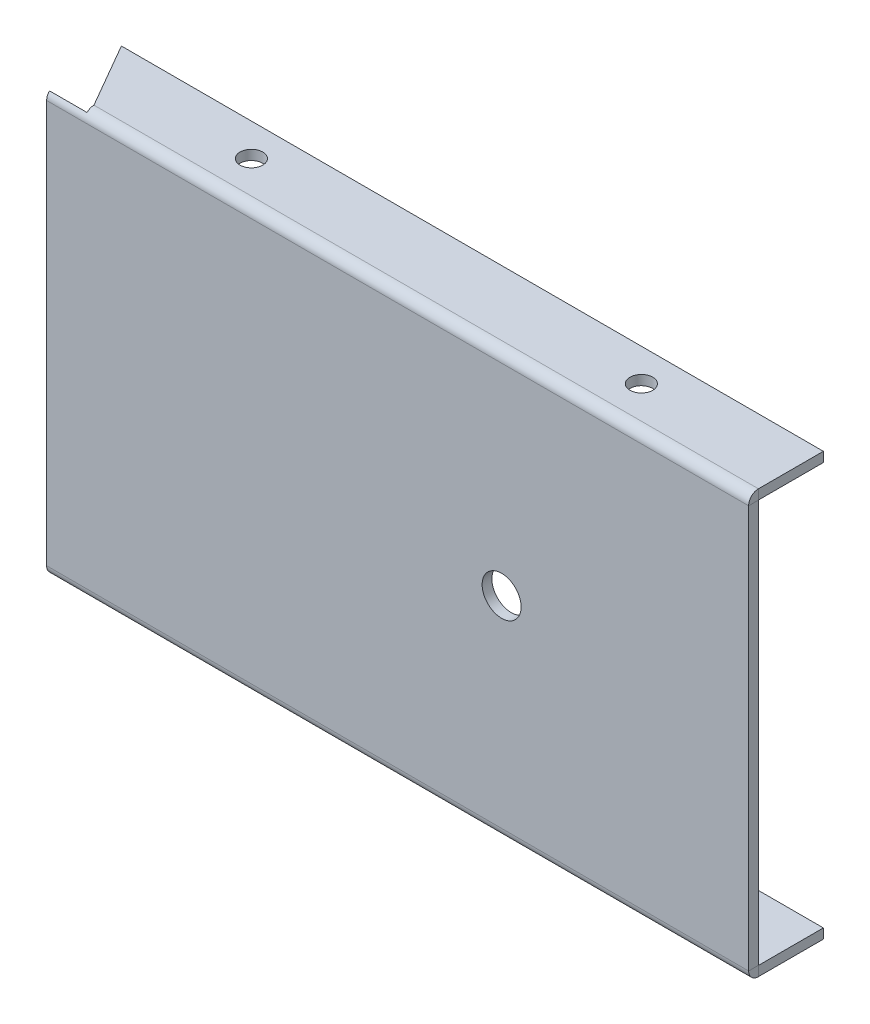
ISO-10303-21;
HEADER;
FILE_DESCRIPTION(('STEP AP214'),'2;1');
FILE_NAME('part.step','',(''),(''),'','','');
FILE_SCHEMA(('AUTOMOTIVE_DESIGN { 1 0 10303 214 1 1 1 1 }'));
ENDSEC;
DATA;
#1=APPLICATION_CONTEXT('core data for automotive mechanical design processes');
#2=APPLICATION_PROTOCOL_DEFINITION('international standard','automotive_design',2000,#1);
#3=PRODUCT_CONTEXT('',#1,'mechanical');
#4=PRODUCT('Part','Part','',(#3));
#5=PRODUCT_RELATED_PRODUCT_CATEGORY('part','',(#4));
#6=PRODUCT_DEFINITION_FORMATION('','',#4);
#7=PRODUCT_DEFINITION_CONTEXT('part definition',#1,'design');
#8=PRODUCT_DEFINITION('design','',#6,#7);
#9=PRODUCT_DEFINITION_SHAPE('','',#8);
#10=(LENGTH_UNIT() NAMED_UNIT(*) SI_UNIT(.MILLI.,.METRE.));
#11=(NAMED_UNIT(*) PLANE_ANGLE_UNIT() SI_UNIT($,.RADIAN.));
#12=(NAMED_UNIT(*) SI_UNIT($,.STERADIAN.) SOLID_ANGLE_UNIT());
#13=UNCERTAINTY_MEASURE_WITH_UNIT(LENGTH_MEASURE(1.E-05),#10,'distance_accuracy_value','');
#14=(GEOMETRIC_REPRESENTATION_CONTEXT(3) GLOBAL_UNCERTAINTY_ASSIGNED_CONTEXT((#13)) GLOBAL_UNIT_ASSIGNED_CONTEXT((#10,
#11,#12)) REPRESENTATION_CONTEXT('',''));
#15=CARTESIAN_POINT('',(0.,0.,0.));
#16=DIRECTION('',(0.,0.,1.));
#17=DIRECTION('',(1.,0.,0.));
#18=AXIS2_PLACEMENT_3D('',#15,#16,#17);
#19=CARTESIAN_POINT('',(0.,10.,1.5));
#20=DIRECTION('',(1.,0.,0.));
#21=DIRECTION('',(0.,0.,-1.));
#22=AXIS2_PLACEMENT_3D('',#19,#20,#21);
#23=PLANE('',#22);
#24=DIRECTION('',(0.,-1.,0.));
#25=VECTOR('',#24,1.);
#26=CARTESIAN_POINT('',(0.,10.,0.));
#27=LINE('',#26,#25);
#28=CARTESIAN_POINT('',(0.,71.9921342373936,0.));
#29=VERTEX_POINT('',#28);
#30=CARTESIAN_POINT('',(0.,10.0078657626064,0.));
#31=VERTEX_POINT('',#30);
#32=EDGE_CURVE('E80',#29,#31,#27,.T.);
#33=ORIENTED_EDGE('',*,*,#32,.T.);
#34=DIRECTION('',(0.,0.,1.));
#35=VECTOR('',#34,1.);
#36=CARTESIAN_POINT('',(0.,10.0078657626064,1.5));
#37=LINE('',#36,#35);
#38=CARTESIAN_POINT('',(0.,10.0078657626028,1.5));
#39=VERTEX_POINT('',#38);
#40=EDGE_CURVE('E567',#31,#39,#37,.T.);
#41=ORIENTED_EDGE('',*,*,#40,.T.);
#42=DIRECTION('',(0.,-1.,0.));
#43=VECTOR('',#42,1.);
#44=CARTESIAN_POINT('',(0.,10.,1.5));
#45=LINE('',#44,#43);
#46=CARTESIAN_POINT('',(0.,71.9921342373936,1.5));
#47=VERTEX_POINT('',#46);
#48=EDGE_CURVE('E531',#47,#39,#45,.T.);
#49=ORIENTED_EDGE('',*,*,#48,.F.);
#50=DIRECTION('',(0.,0.,1.));
#51=VECTOR('',#50,1.);
#52=CARTESIAN_POINT('',(0.,71.9921342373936,1.50000000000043));
#53=LINE('',#52,#51);
#54=EDGE_CURVE('E536',#29,#47,#53,.T.);
#55=ORIENTED_EDGE('',*,*,#54,.F.);
#56=EDGE_LOOP('',(#33,#41,#49,#55));
#57=FACE_BOUND('',#56,.T.);
#58=ADVANCED_FACE('F55',(#57),#23,.F.);
#59=CARTESIAN_POINT('',(108.,82.,1.5));
#60=DIRECTION('',(-1.,0.,0.));
#61=DIRECTION('',(0.,-1.,0.));
#62=AXIS2_PLACEMENT_3D('',#59,#60,#61);
#63=PLANE('',#62);
#64=DIRECTION('',(0.,1.,0.));
#65=VECTOR('',#64,1.);
#66=CARTESIAN_POINT('',(108.,82.,1.5));
#67=LINE('',#66,#65);
#68=CARTESIAN_POINT('',(108.,10.0078657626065,1.5));
#69=VERTEX_POINT('',#68);
#70=CARTESIAN_POINT('',(108.,71.9921342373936,1.5));
#71=VERTEX_POINT('',#70);
#72=EDGE_CURVE('E572',#69,#71,#67,.T.);
#73=ORIENTED_EDGE('',*,*,#72,.F.);
#74=DIRECTION('',(0.,0.,-1.));
#75=VECTOR('',#74,1.);
#76=CARTESIAN_POINT('',(108.,10.0078657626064,1.4999999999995));
#77=LINE('',#76,#75);
#78=CARTESIAN_POINT('',(108.,10.0078657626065,0.));
#79=VERTEX_POINT('',#78);
#80=EDGE_CURVE('E12',#69,#79,#77,.T.);
#81=ORIENTED_EDGE('',*,*,#80,.T.);
#82=DIRECTION('',(0.,1.,0.));
#83=VECTOR('',#82,1.);
#84=CARTESIAN_POINT('',(108.,82.,0.));
#85=LINE('',#84,#83);
#86=CARTESIAN_POINT('',(108.,71.9921342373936,0.));
#87=VERTEX_POINT('',#86);
#88=EDGE_CURVE('E525',#79,#87,#85,.T.);
#89=ORIENTED_EDGE('',*,*,#88,.T.);
#90=DIRECTION('',(0.,0.,-1.));
#91=VECTOR('',#90,1.);
#92=CARTESIAN_POINT('',(108.,71.9921342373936,1.49999999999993));
#93=LINE('',#92,#91);
#94=EDGE_CURVE('E530',#71,#87,#93,.T.);
#95=ORIENTED_EDGE('',*,*,#94,.F.);
#96=EDGE_LOOP('',(#73,#81,#89,#95));
#97=FACE_BOUND('',#96,.T.);
#98=ADVANCED_FACE('F57',(#97),#63,.F.);
#99=CARTESIAN_POINT('',(0.,0.,1.5));
#100=DIRECTION('',(0.,0.,-1.));
#101=DIRECTION('',(-1.,0.,0.));
#102=AXIS2_PLACEMENT_3D('',#99,#100,#101);
#103=PLANE('',#102);
#104=CARTESIAN_POINT('',(70.,41.,1.5));
#105=DIRECTION('',(0.,0.,1.));
#106=DIRECTION('',(1.,0.,0.));
#107=AXIS2_PLACEMENT_3D('',#104,#105,#106);
#108=CIRCLE('',#107,2.99999999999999);
#109=CARTESIAN_POINT('',(73.,41.,1.5));
#110=VERTEX_POINT('',#109);
#111=EDGE_CURVE('E493',#110,#110,#108,.T.);
#112=ORIENTED_EDGE('',*,*,#111,.F.);
#113=EDGE_LOOP('',(#112));
#114=FACE_BOUND('',#113,.T.);
#115=ORIENTED_EDGE('',*,*,#48,.T.);
#116=DIRECTION('',(1.,0.,0.));
#117=VECTOR('',#116,1.);
#118=CARTESIAN_POINT('',(0.,10.0078657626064,1.5));
#119=LINE('',#118,#117);
#120=EDGE_CURVE('E539',#39,#69,#119,.T.);
#121=ORIENTED_EDGE('',*,*,#120,.T.);
#122=ORIENTED_EDGE('',*,*,#72,.T.);
#123=DIRECTION('',(1.,0.,0.));
#124=VECTOR('',#123,1.);
#125=CARTESIAN_POINT('',(0.,71.9921342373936,1.5));
#126=LINE('',#125,#124);
#127=EDGE_CURVE('E527',#47,#71,#126,.T.);
#128=ORIENTED_EDGE('',*,*,#127,.F.);
#129=EDGE_LOOP('',(#115,#121,#122,#128));
#130=FACE_BOUND('',#129,.T.);
#131=ADVANCED_FACE('F513',(#114,#130),#103,.F.);
#132=CARTESIAN_POINT('',(0.,0.,0.));
#133=DIRECTION('',(0.,0.,-1.));
#134=DIRECTION('',(-1.,0.,0.));
#135=AXIS2_PLACEMENT_3D('',#132,#133,#134);
#136=PLANE('',#135);
#137=DIRECTION('',(1.,0.,0.));
#138=VECTOR('',#137,1.);
#139=CARTESIAN_POINT('',(0.,10.0078657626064,0.));
#140=LINE('',#139,#138);
#141=EDGE_CURVE('E64',#31,#79,#140,.T.);
#142=ORIENTED_EDGE('',*,*,#141,.F.);
#143=ORIENTED_EDGE('',*,*,#32,.F.);
#144=DIRECTION('',(1.,0.,0.));
#145=VECTOR('',#144,1.);
#146=CARTESIAN_POINT('',(0.,71.9921342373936,0.));
#147=LINE('',#146,#145);
#148=EDGE_CURVE('E534',#29,#87,#147,.T.);
#149=ORIENTED_EDGE('',*,*,#148,.T.);
#150=ORIENTED_EDGE('',*,*,#88,.F.);
#151=EDGE_LOOP('',(#142,#143,#149,#150));
#152=FACE_BOUND('',#151,.T.);
#153=CARTESIAN_POINT('',(70.,41.,0.));
#154=DIRECTION('',(0.,0.,1.));
#155=DIRECTION('',(1.,0.,0.));
#156=AXIS2_PLACEMENT_3D('',#153,#154,#155);
#157=CIRCLE('',#156,2.99999999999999);
#158=CARTESIAN_POINT('',(73.,41.,0.));
#159=VERTEX_POINT('',#158);
#160=EDGE_CURVE('E475',#159,#159,#157,.T.);
#161=ORIENTED_EDGE('',*,*,#160,.T.);
#162=EDGE_LOOP('',(#161));
#163=FACE_BOUND('',#162,.T.);
#164=ADVANCED_FACE('F508',(#152,#163),#136,.T.);
#165=CARTESIAN_POINT('',(70.,41.,1.5));
#166=DIRECTION('',(0.,0.,-1.));
#167=DIRECTION('',(-1.,0.,0.));
#168=AXIS2_PLACEMENT_3D('',#165,#166,#167);
#169=CYLINDRICAL_SURFACE('',#168,2.99999999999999);
#170=ORIENTED_EDGE('',*,*,#111,.T.);
#171=EDGE_LOOP('',(#170));
#172=FACE_BOUND('',#171,.T.);
#173=ORIENTED_EDGE('',*,*,#160,.F.);
#174=EDGE_LOOP('',(#173));
#175=FACE_BOUND('',#174,.T.);
#176=ADVANCED_FACE('F505',(#172,#175),#169,.F.);
#177=CARTESIAN_POINT('',(0.,71.9921342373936,-0.01));
#178=DIRECTION('',(-1.,0.,0.));
#179=DIRECTION('',(0.,-1.,0.));
#180=AXIS2_PLACEMENT_3D('',#177,#178,#179);
#181=PLANE('',#180);
#182=DIRECTION('',(0.,0.707106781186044,0.707106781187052));
#183=VECTOR('',#182,1.);
#184=CARTESIAN_POINT('',(0.,73.0598654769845,1.05773123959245));
#185=LINE('',#184,#183);
#186=CARTESIAN_POINT('',(0.,71.9992053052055,-0.00292893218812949));
#187=VERTEX_POINT('',#186);
#188=CARTESIAN_POINT('',(0.,73.0598654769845,1.05773123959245));
#189=VERTEX_POINT('',#188);
#190=EDGE_CURVE('E468',#187,#189,#185,.T.);
#191=ORIENTED_EDGE('',*,*,#190,.F.);
#192=CARTESIAN_POINT('',(0.,71.9921342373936,-0.01));
#193=DIRECTION('',(-1.,0.,0.));
#194=DIRECTION('',(0.,-1.,0.));
#195=AXIS2_PLACEMENT_3D('',#192,#193,#194);
#196=CIRCLE('',#195,0.01);
#197=EDGE_CURVE('E351',#187,#29,#196,.F.);
#198=ORIENTED_EDGE('',*,*,#197,.T.);
#199=ORIENTED_EDGE('',*,*,#54,.T.);
#200=CARTESIAN_POINT('',(0.,71.9921342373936,-0.01));
#201=DIRECTION('',(1.,0.,0.));
#202=DIRECTION('',(0.,1.,0.));
#203=AXIS2_PLACEMENT_3D('',#200,#201,#202);
#204=CIRCLE('',#203,1.51);
#205=EDGE_CURVE('E383',#189,#47,#204,.T.);
#206=ORIENTED_EDGE('',*,*,#205,.F.);
#207=EDGE_LOOP('',(#191,#198,#199,#206));
#208=FACE_BOUND('',#207,.T.);
#209=ADVANCED_FACE('F504',(#208),#181,.T.);
#210=CARTESIAN_POINT('',(108.,71.9921342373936,-0.01));
#211=DIRECTION('',(1.,0.,0.));
#212=DIRECTION('',(0.,0.,-1.));
#213=AXIS2_PLACEMENT_3D('',#210,#211,#212);
#214=PLANE('',#213);
#215=ORIENTED_EDGE('',*,*,#94,.T.);
#216=CARTESIAN_POINT('',(108.,71.9921342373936,-0.01));
#217=DIRECTION('',(-1.,0.,0.));
#218=DIRECTION('',(0.,-1.,0.));
#219=AXIS2_PLACEMENT_3D('',#216,#217,#218);
#220=CIRCLE('',#219,0.01);
#221=CARTESIAN_POINT('',(108.,72.0021342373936,-0.00999999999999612));
#222=VERTEX_POINT('',#221);
#223=EDGE_CURVE('E395',#87,#222,#220,.T.);
#224=ORIENTED_EDGE('',*,*,#223,.T.);
#225=DIRECTION('',(0.,-1.,0.));
#226=VECTOR('',#225,1.);
#227=CARTESIAN_POINT('',(108.,73.5021342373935,-0.00999999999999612));
#228=LINE('',#227,#226);
#229=CARTESIAN_POINT('',(108.,73.5021342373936,-0.00999999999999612));
#230=VERTEX_POINT('',#229);
#231=EDGE_CURVE('E362',#230,#222,#228,.T.);
#232=ORIENTED_EDGE('',*,*,#231,.F.);
#233=CARTESIAN_POINT('',(108.,71.9921342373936,-0.01));
#234=DIRECTION('',(-1.,0.,0.));
#235=DIRECTION('',(0.,0.,1.));
#236=AXIS2_PLACEMENT_3D('',#233,#234,#235);
#237=CIRCLE('',#236,1.51000000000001);
#238=EDGE_CURVE('E386',#71,#230,#237,.T.);
#239=ORIENTED_EDGE('',*,*,#238,.F.);
#240=EDGE_LOOP('',(#215,#224,#232,#239));
#241=FACE_BOUND('',#240,.T.);
#242=ADVANCED_FACE('F629',(#241),#214,.T.);
#243=CARTESIAN_POINT('',(5.76896139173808,73.5021342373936,-0.0100000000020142));
#244=CARTESIAN_POINT('',(5.76971841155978,73.5021342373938,0.187694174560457));
#245=CARTESIAN_POINT('',(5.77047515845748,73.4628329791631,0.385239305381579));
#246=CARTESIAN_POINT('',(5.77198892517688,73.3115516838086,0.750464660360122));
#247=CARTESIAN_POINT('',(5.77274567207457,73.1996563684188,0.917940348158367));
#248=CARTESIAN_POINT('',(5.77350269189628,73.0598654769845,1.05773123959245));
#249=CARTESIAN_POINT('',(5.76896139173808,72.0021342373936,-0.0100000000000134));
#250=CARTESIAN_POINT('',(5.76971837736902,72.0021342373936,-0.00869082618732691));
#251=CARTESIAN_POINT('',(5.77047515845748,72.0018739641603,-0.00738252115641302));
#252=CARTESIAN_POINT('',(5.77198892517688,72.0008721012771,-0.00496381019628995));
#253=CARTESIAN_POINT('',(5.77274570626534,72.0001310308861,-0.00385465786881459));
#254=CARTESIAN_POINT('',(5.77350269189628,71.9992053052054,-0.00292893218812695));
#255=B_SPLINE_SURFACE_WITH_KNOTS('',1,3,((#243,#244,#245,#246,#247,#248),(#249,#250,#251,#252,
#253,#254)),.UNSPECIFIED.,.F.,.F.,.F.,(2,2),(4,2,4),(0.,1.),(0.,0.5,1.),.UNSPECIFIED.);
#256=CARTESIAN_POINT('',(5.76896139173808,73.5021342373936,-0.0100000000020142));
#257=CARTESIAN_POINT('',(5.76896139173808,72.0021342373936,-0.0100000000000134));
#258=B_SPLINE_CURVE_WITH_KNOTS('',1,(#256,#257),.UNSPECIFIED.,.F.,.F.,(2,2),(0.,1.),.UNSPECIFIED.);
#259=CARTESIAN_POINT('',(5.76896139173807,72.0021342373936,-0.01000000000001));
#260=VERTEX_POINT('',#259);
#261=CARTESIAN_POINT('',(5.76896139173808,73.5021342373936,-0.0100000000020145));
#262=VERTEX_POINT('',#261);
#263=EDGE_CURVE('E352',#260,#262,#258,.F.);
#264=CARTESIAN_POINT('',(5.76896139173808,72.0021342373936,-0.0100000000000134));
#265=CARTESIAN_POINT('',(5.76971837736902,72.0021342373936,-0.00869082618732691));
#266=CARTESIAN_POINT('',(5.77047515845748,72.0018739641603,-0.00738252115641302));
#267=CARTESIAN_POINT('',(5.77198892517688,72.0008721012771,-0.00496381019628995));
#268=CARTESIAN_POINT('',(5.77274570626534,72.0001310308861,-0.00385465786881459));
#269=CARTESIAN_POINT('',(5.77350269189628,71.9992053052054,-0.00292893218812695));
#270=B_SPLINE_CURVE_WITH_KNOTS('',3,(#264,#265,#266,#267,#268,#269),.UNSPECIFIED.,.F.,.F.,(4,2,
4),(0.,0.5,1.),.UNSPECIFIED.);
#271=CARTESIAN_POINT('',(5.77350269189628,71.9992053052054,-0.0029289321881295));
#272=VERTEX_POINT('',#271);
#273=EDGE_CURVE('E437',#260,#272,#270,.T.);
#274=CARTESIAN_POINT('',(5.77350269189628,71.9992053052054,-0.00292893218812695));
#275=CARTESIAN_POINT('',(5.77350269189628,73.0598654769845,1.05773123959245));
#276=B_SPLINE_CURVE_WITH_KNOTS('',1,(#274,#275),.UNSPECIFIED.,.F.,.F.,(2,2),(0.,1.),.UNSPECIFIED.);
#277=CARTESIAN_POINT('',(5.77350269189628,73.0598654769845,1.05773123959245));
#278=VERTEX_POINT('',#277);
#279=EDGE_CURVE('E476',#272,#278,#276,.T.);
#280=CARTESIAN_POINT('',(5.77350269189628,73.0598654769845,1.05773123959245));
#281=CARTESIAN_POINT('',(5.77274567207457,73.1996563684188,0.917940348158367));
#282=CARTESIAN_POINT('',(5.77198892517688,73.3115516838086,0.750464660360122));
#283=CARTESIAN_POINT('',(5.77047515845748,73.4628329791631,0.385239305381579));
#284=CARTESIAN_POINT('',(5.76971841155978,73.5021342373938,0.187694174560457));
#285=CARTESIAN_POINT('',(5.76896139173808,73.5021342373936,-0.0100000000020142));
#286=B_SPLINE_CURVE_WITH_KNOTS('',3,(#280,#281,#282,#283,#284,#285),.UNSPECIFIED.,.F.,.F.,(4,2,
4),(0.,0.5,1.),.UNSPECIFIED.);
#287=EDGE_CURVE('E390',#262,#278,#286,.F.);
#288=ORIENTED_EDGE('',*,*,#263,.F.);
#289=ORIENTED_EDGE('',*,*,#273,.T.);
#290=ORIENTED_EDGE('',*,*,#279,.T.);
#291=ORIENTED_EDGE('',*,*,#287,.F.);
#292=EDGE_LOOP('',(#288,#289,#290,#291));
#293=FACE_BOUND('',#292,.T.);
#294=ADVANCED_FACE('F411',(#293),#255,.T.);
#295=CARTESIAN_POINT('',(2.88675134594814,73.0598654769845,1.05773123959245));
#296=DIRECTION('',(0.,0.70710678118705,-0.707106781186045));
#297=DIRECTION('',(-1.,0.,0.));
#298=AXIS2_PLACEMENT_3D('',#295,#296,#297);
#299=PLANE('',#298);
#300=DIRECTION('',(-1.,0.,0.));
#301=VECTOR('',#300,1.);
#302=CARTESIAN_POINT('',(162.010417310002,71.9992053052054,-0.00292893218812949));
#303=LINE('',#302,#301);
#304=EDGE_CURVE('E387',#272,#187,#303,.T.);
#305=ORIENTED_EDGE('',*,*,#304,.T.);
#306=ORIENTED_EDGE('',*,*,#190,.T.);
#307=DIRECTION('',(-1.,0.,0.));
#308=VECTOR('',#307,1.);
#309=CARTESIAN_POINT('',(5.77350269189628,73.0598654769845,1.05773123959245));
#310=LINE('',#309,#308);
#311=EDGE_CURVE('E617',#278,#189,#310,.T.);
#312=ORIENTED_EDGE('',*,*,#311,.F.);
#313=ORIENTED_EDGE('',*,*,#279,.F.);
#314=EDGE_LOOP('',(#305,#306,#312,#313));
#315=FACE_BOUND('',#314,.T.);
#316=ADVANCED_FACE('F409',(#315),#299,.T.);
#317=CARTESIAN_POINT('',(162.010417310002,71.9921342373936,-0.01));
#318=DIRECTION('',(-1.,0.,0.));
#319=DIRECTION('',(0.,-1.,0.));
#320=AXIS2_PLACEMENT_3D('',#317,#318,#319);
#321=CYLINDRICAL_SURFACE('',#320,1.51);
#322=ORIENTED_EDGE('',*,*,#287,.T.);
#323=ORIENTED_EDGE('',*,*,#311,.T.);
#324=ORIENTED_EDGE('',*,*,#205,.T.);
#325=ORIENTED_EDGE('',*,*,#127,.T.);
#326=ORIENTED_EDGE('',*,*,#238,.T.);
#327=DIRECTION('',(1.,0.,0.));
#328=VECTOR('',#327,1.);
#329=CARTESIAN_POINT('',(0.,73.5021342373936,-0.00999999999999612));
#330=LINE('',#329,#328);
#331=EDGE_CURVE('E369',#262,#230,#330,.T.);
#332=ORIENTED_EDGE('',*,*,#331,.F.);
#333=EDGE_LOOP('',(#322,#323,#324,#325,#326,#332));
#334=FACE_BOUND('',#333,.T.);
#335=ADVANCED_FACE('F398',(#334),#321,.T.);
#336=CARTESIAN_POINT('',(162.010417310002,71.9921342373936,-0.01));
#337=DIRECTION('',(-1.,0.,0.));
#338=DIRECTION('',(0.,-1.,0.));
#339=AXIS2_PLACEMENT_3D('',#336,#337,#338);
#340=CYLINDRICAL_SURFACE('',#339,0.01);
#341=ORIENTED_EDGE('',*,*,#273,.F.);
#342=DIRECTION('',(1.,0.,0.));
#343=VECTOR('',#342,1.);
#344=CARTESIAN_POINT('',(0.,72.0021342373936,-0.01000000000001));
#345=LINE('',#344,#343);
#346=EDGE_CURVE('E382',#260,#222,#345,.T.);
#347=ORIENTED_EDGE('',*,*,#346,.T.);
#348=ORIENTED_EDGE('',*,*,#223,.F.);
#349=ORIENTED_EDGE('',*,*,#148,.F.);
#350=ORIENTED_EDGE('',*,*,#197,.F.);
#351=ORIENTED_EDGE('',*,*,#304,.F.);
#352=EDGE_LOOP('',(#341,#347,#348,#349,#350,#351));
#353=FACE_BOUND('',#352,.T.);
#354=ADVANCED_FACE('F408',(#353),#340,.F.);
#355=CARTESIAN_POINT('',(0.,73.5021342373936,-10.0021342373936));
#356=DIRECTION('',(0.,0.,1.));
#357=DIRECTION('',(0.,-1.,0.));
#358=AXIS2_PLACEMENT_3D('',#355,#356,#357);
#359=PLANE('',#358);
#360=DIRECTION('',(-1.,0.,0.));
#361=VECTOR('',#360,1.);
#362=CARTESIAN_POINT('',(0.,72.0021342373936,-10.0021342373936));
#363=LINE('',#362,#361);
#364=CARTESIAN_POINT('',(108.,72.0021342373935,-10.0021342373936));
#365=VERTEX_POINT('',#364);
#366=CARTESIAN_POINT('',(0.,72.0021342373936,-10.0021342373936));
#367=VERTEX_POINT('',#366);
#368=EDGE_CURVE('E380',#365,#367,#363,.T.);
#369=ORIENTED_EDGE('',*,*,#368,.T.);
#370=DIRECTION('',(0.,-1.,0.));
#371=VECTOR('',#370,1.);
#372=CARTESIAN_POINT('',(0.,73.5021342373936,-10.0021342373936));
#373=LINE('',#372,#371);
#374=CARTESIAN_POINT('',(0.,73.5021342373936,-10.0021342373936));
#375=VERTEX_POINT('',#374);
#376=EDGE_CURVE('E348',#375,#367,#373,.T.);
#377=ORIENTED_EDGE('',*,*,#376,.F.);
#378=DIRECTION('',(-1.,0.,0.));
#379=VECTOR('',#378,1.);
#380=CARTESIAN_POINT('',(0.,73.5021342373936,-10.0021342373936));
#381=LINE('',#380,#379);
#382=CARTESIAN_POINT('',(108.,73.5021342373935,-10.0021342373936));
#383=VERTEX_POINT('',#382);
#384=EDGE_CURVE('E365',#383,#375,#381,.T.);
#385=ORIENTED_EDGE('',*,*,#384,.F.);
#386=DIRECTION('',(0.,-1.,0.));
#387=VECTOR('',#386,1.);
#388=CARTESIAN_POINT('',(108.,73.5021342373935,-10.0021342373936));
#389=LINE('',#388,#387);
#390=EDGE_CURVE('E377',#383,#365,#389,.T.);
#391=ORIENTED_EDGE('',*,*,#390,.T.);
#392=EDGE_LOOP('',(#369,#377,#385,#391));
#393=FACE_BOUND('',#392,.T.);
#394=ADVANCED_FACE('F417',(#393),#359,.F.);
#395=CARTESIAN_POINT('',(85.,73.5021342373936,-5.00213423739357));
#396=DIRECTION('',(0.,-1.,0.));
#397=DIRECTION('',(-1.,0.,0.));
#398=AXIS2_PLACEMENT_3D('',#395,#396,#397);
#399=CYLINDRICAL_SURFACE('',#398,1.75);
#400=CARTESIAN_POINT('',(85.,73.5021342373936,-5.00213423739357));
#401=DIRECTION('',(0.,1.,0.));
#402=DIRECTION('',(1.,0.,0.));
#403=AXIS2_PLACEMENT_3D('',#400,#401,#402);
#404=CIRCLE('',#403,1.75);
#405=CARTESIAN_POINT('',(86.75,73.5021342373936,-5.00213423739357));
#406=VERTEX_POINT('',#405);
#407=EDGE_CURVE('E374',#406,#406,#404,.T.);
#408=ORIENTED_EDGE('',*,*,#407,.T.);
#409=EDGE_LOOP('',(#408));
#410=FACE_BOUND('',#409,.T.);
#411=CARTESIAN_POINT('',(85.,72.0021342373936,-5.00213423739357));
#412=DIRECTION('',(0.,1.,0.));
#413=DIRECTION('',(1.,0.,0.));
#414=AXIS2_PLACEMENT_3D('',#411,#412,#413);
#415=CIRCLE('',#414,1.75);
#416=CARTESIAN_POINT('',(86.75,72.0021342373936,-5.00213423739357));
#417=VERTEX_POINT('',#416);
#418=EDGE_CURVE('E357',#417,#417,#415,.T.);
#419=ORIENTED_EDGE('',*,*,#418,.F.);
#420=EDGE_LOOP('',(#419));
#421=FACE_BOUND('',#420,.T.);
#422=ADVANCED_FACE('F867',(#410,#421),#399,.F.);
#423=CARTESIAN_POINT('',(25.,73.5021342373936,-5.00213423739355));
#424=DIRECTION('',(0.,-1.,0.));
#425=DIRECTION('',(-1.,0.,0.));
#426=AXIS2_PLACEMENT_3D('',#423,#424,#425);
#427=CYLINDRICAL_SURFACE('',#426,1.75);
#428=CARTESIAN_POINT('',(25.,73.5021342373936,-5.00213423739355));
#429=DIRECTION('',(0.,1.,0.));
#430=DIRECTION('',(1.,0.,0.));
#431=AXIS2_PLACEMENT_3D('',#428,#429,#430);
#432=CIRCLE('',#431,1.75);
#433=CARTESIAN_POINT('',(26.75,73.5021342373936,-5.00213423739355));
#434=VERTEX_POINT('',#433);
#435=EDGE_CURVE('E370',#434,#434,#432,.T.);
#436=ORIENTED_EDGE('',*,*,#435,.T.);
#437=EDGE_LOOP('',(#436));
#438=FACE_BOUND('',#437,.T.);
#439=CARTESIAN_POINT('',(25.,72.0021342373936,-5.00213423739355));
#440=DIRECTION('',(0.,1.,0.));
#441=DIRECTION('',(1.,0.,0.));
#442=AXIS2_PLACEMENT_3D('',#439,#440,#441);
#443=CIRCLE('',#442,1.75);
#444=CARTESIAN_POINT('',(26.75,72.0021342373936,-5.00213423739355));
#445=VERTEX_POINT('',#444);
#446=EDGE_CURVE('E353',#445,#445,#443,.T.);
#447=ORIENTED_EDGE('',*,*,#446,.F.);
#448=EDGE_LOOP('',(#447));
#449=FACE_BOUND('',#448,.T.);
#450=ADVANCED_FACE('F784',(#438,#449),#427,.F.);
#451=CARTESIAN_POINT('',(0.,73.5021342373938,71.9978657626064));
#452=DIRECTION('',(0.,-1.,0.));
#453=DIRECTION('',(-1.,0.,0.));
#454=AXIS2_PLACEMENT_3D('',#451,#452,#453);
#455=PLANE('',#454);
#456=ORIENTED_EDGE('',*,*,#435,.F.);
#457=EDGE_LOOP('',(#456));
#458=FACE_BOUND('',#457,.T.);
#459=ORIENTED_EDGE('',*,*,#407,.F.);
#460=EDGE_LOOP('',(#459));
#461=FACE_BOUND('',#460,.T.);
#462=DIRECTION('',(0.500000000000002,0.,0.866025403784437));
#463=VECTOR('',#462,1.);
#464=CARTESIAN_POINT('',(5.77350269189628,73.5021342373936,-0.002134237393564));
#465=LINE('',#464,#463);
#466=EDGE_CURVE('E373',#375,#262,#465,.T.);
#467=ORIENTED_EDGE('',*,*,#466,.T.);
#468=ORIENTED_EDGE('',*,*,#331,.T.);
#469=DIRECTION('',(0.,0.,-1.));
#470=VECTOR('',#469,1.);
#471=CARTESIAN_POINT('',(108.,73.5021342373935,-10.0021342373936));
#472=LINE('',#471,#470);
#473=EDGE_CURVE('E367',#230,#383,#472,.T.);
#474=ORIENTED_EDGE('',*,*,#473,.T.);
#475=ORIENTED_EDGE('',*,*,#384,.T.);
#476=EDGE_LOOP('',(#467,#468,#474,#475));
#477=FACE_BOUND('',#476,.T.);
#478=ADVANCED_FACE('F645',(#458,#461,#477),#455,.F.);
#479=CARTESIAN_POINT('',(108.,73.5021342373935,-10.0021342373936));
#480=DIRECTION('',(-1.,0.,0.));
#481=DIRECTION('',(0.,0.,1.));
#482=AXIS2_PLACEMENT_3D('',#479,#480,#481);
#483=PLANE('',#482);
#484=ORIENTED_EDGE('',*,*,#473,.F.);
#485=ORIENTED_EDGE('',*,*,#231,.T.);
#486=DIRECTION('',(0.,0.,-1.));
#487=VECTOR('',#486,1.);
#488=CARTESIAN_POINT('',(108.,72.0021342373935,-10.0021342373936));
#489=LINE('',#488,#487);
#490=EDGE_CURVE('E360',#222,#365,#489,.T.);
#491=ORIENTED_EDGE('',*,*,#490,.T.);
#492=ORIENTED_EDGE('',*,*,#390,.F.);
#493=EDGE_LOOP('',(#484,#485,#491,#492));
#494=FACE_BOUND('',#493,.T.);
#495=ADVANCED_FACE('F642',(#494),#483,.F.);
#496=CARTESIAN_POINT('',(0.,72.0021342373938,71.9978657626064));
#497=DIRECTION('',(0.,-1.,0.));
#498=DIRECTION('',(-1.,0.,0.));
#499=AXIS2_PLACEMENT_3D('',#496,#497,#498);
#500=PLANE('',#499);
#501=ORIENTED_EDGE('',*,*,#346,.F.);
#502=DIRECTION('',(0.500000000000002,0.,0.866025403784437));
#503=VECTOR('',#502,1.);
#504=CARTESIAN_POINT('',(5.77350269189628,72.0021342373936,-0.002134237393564));
#505=LINE('',#504,#503);
#506=EDGE_CURVE('E356',#367,#260,#505,.T.);
#507=ORIENTED_EDGE('',*,*,#506,.F.);
#508=ORIENTED_EDGE('',*,*,#368,.F.);
#509=ORIENTED_EDGE('',*,*,#490,.F.);
#510=EDGE_LOOP('',(#501,#507,#508,#509));
#511=FACE_BOUND('',#510,.T.);
#512=ORIENTED_EDGE('',*,*,#418,.T.);
#513=EDGE_LOOP('',(#512));
#514=FACE_BOUND('',#513,.T.);
#515=ORIENTED_EDGE('',*,*,#446,.T.);
#516=EDGE_LOOP('',(#515));
#517=FACE_BOUND('',#516,.T.);
#518=ADVANCED_FACE('F636',(#511,#514,#517),#500,.T.);
#519=CARTESIAN_POINT('',(5.77350269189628,73.5021342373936,-0.002134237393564));
#520=DIRECTION('',(0.866025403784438,0.,-0.500000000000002));
#521=DIRECTION('',(-0.500000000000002,0.,-0.866025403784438));
#522=AXIS2_PLACEMENT_3D('',#519,#520,#521);
#523=PLANE('',#522);
#524=ORIENTED_EDGE('',*,*,#506,.T.);
#525=ORIENTED_EDGE('',*,*,#263,.T.);
#526=ORIENTED_EDGE('',*,*,#466,.F.);
#527=ORIENTED_EDGE('',*,*,#376,.T.);
#528=EDGE_LOOP('',(#524,#525,#526,#527));
#529=FACE_BOUND('',#528,.T.);
#530=ADVANCED_FACE('F302',(#529),#523,.F.);
#531=CARTESIAN_POINT('',(5.77350269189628,8.94013452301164,1.05773123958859));
#532=CARTESIAN_POINT('',(5.77274567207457,8.80034363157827,0.917940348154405));
#533=CARTESIAN_POINT('',(5.77198892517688,8.68844831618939,0.750464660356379));
#534=CARTESIAN_POINT('',(5.77047515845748,8.53716702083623,0.385239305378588));
#535=CARTESIAN_POINT('',(5.76971841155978,8.49786576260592,0.187694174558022));
#536=CARTESIAN_POINT('',(5.76896139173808,8.49786576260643,-0.0100000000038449));
#537=CARTESIAN_POINT('',(5.77350269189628,10.0007946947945,-0.00292893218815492));
#538=CARTESIAN_POINT('',(5.77274570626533,9.99986896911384,-0.00385465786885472));
#539=CARTESIAN_POINT('',(5.77198892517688,9.99912789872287,-0.00496381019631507));
#540=CARTESIAN_POINT('',(5.77047515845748,9.99812603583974,-0.00738252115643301));
#541=CARTESIAN_POINT('',(5.76971837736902,9.99786576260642,-0.00869082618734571));
#542=CARTESIAN_POINT('',(5.76896139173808,9.99786576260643,-0.0100000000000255));
#543=B_SPLINE_SURFACE_WITH_KNOTS('',1,3,((#531,#532,#533,#534,#535,#536),(#537,#538,#539,#540,
#541,#542)),.UNSPECIFIED.,.F.,.F.,.F.,(2,2),(4,2,4),(0.,1.),(0.,0.5,1.),.UNSPECIFIED.);
#544=CARTESIAN_POINT('',(5.77350269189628,8.94013452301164,1.05773123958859));
#545=CARTESIAN_POINT('',(5.77350269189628,10.0007946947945,-0.00292893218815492));
#546=B_SPLINE_CURVE_WITH_KNOTS('',1,(#544,#545),.UNSPECIFIED.,.F.,.F.,(2,2),(0.,1.),.UNSPECIFIED.);
#547=CARTESIAN_POINT('',(5.77350269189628,10.0007946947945,-0.00292893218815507));
#548=VERTEX_POINT('',#547);
#549=CARTESIAN_POINT('',(5.77350269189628,8.94013452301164,1.05773123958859));
#550=VERTEX_POINT('',#549);
#551=EDGE_CURVE('E329',#548,#550,#546,.F.);
#552=CARTESIAN_POINT('',(5.77350269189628,10.0007946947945,-0.00292893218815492));
#553=CARTESIAN_POINT('',(5.77274570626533,9.99986896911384,-0.00385465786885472));
#554=CARTESIAN_POINT('',(5.77198892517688,9.99912789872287,-0.00496381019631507));
#555=CARTESIAN_POINT('',(5.77047515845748,9.99812603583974,-0.00738252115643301));
#556=CARTESIAN_POINT('',(5.76971837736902,9.99786576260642,-0.00869082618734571));
#557=CARTESIAN_POINT('',(5.76896139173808,9.99786576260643,-0.0100000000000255));
#558=B_SPLINE_CURVE_WITH_KNOTS('',3,(#552,#553,#554,#555,#556,#557),.UNSPECIFIED.,.F.,.F.,(4,2,
4),(0.,0.5,1.),.UNSPECIFIED.);
#559=CARTESIAN_POINT('',(5.76896139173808,9.99786576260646,-0.0100000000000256));
#560=VERTEX_POINT('',#559);
#561=EDGE_CURVE('E200',#548,#560,#558,.T.);
#562=CARTESIAN_POINT('',(5.76896139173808,9.99786576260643,-0.0100000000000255));
#563=CARTESIAN_POINT('',(5.76896139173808,8.49786576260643,-0.0100000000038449));
#564=B_SPLINE_CURVE_WITH_KNOTS('',1,(#562,#563),.UNSPECIFIED.,.F.,.F.,(2,2),(0.,1.),.UNSPECIFIED.);
#565=CARTESIAN_POINT('',(5.76896139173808,8.49786576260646,-0.0100000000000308));
#566=VERTEX_POINT('',#565);
#567=EDGE_CURVE('E220',#560,#566,#564,.T.);
#568=CARTESIAN_POINT('',(5.76896139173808,8.49786576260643,-0.0100000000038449));
#569=CARTESIAN_POINT('',(5.76971841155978,8.49786576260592,0.187694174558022));
#570=CARTESIAN_POINT('',(5.77047515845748,8.53716702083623,0.385239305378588));
#571=CARTESIAN_POINT('',(5.77198892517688,8.68844831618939,0.750464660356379));
#572=CARTESIAN_POINT('',(5.77274567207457,8.80034363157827,0.917940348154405));
#573=CARTESIAN_POINT('',(5.77350269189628,8.94013452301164,1.05773123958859));
#574=B_SPLINE_CURVE_WITH_KNOTS('',3,(#568,#569,#570,#571,#572,#573),.UNSPECIFIED.,.F.,.F.,(4,2,
4),(0.,0.5,1.),.UNSPECIFIED.);
#575=EDGE_CURVE('E227',#550,#566,#574,.F.);
#576=ORIENTED_EDGE('',*,*,#551,.F.);
#577=ORIENTED_EDGE('',*,*,#561,.T.);
#578=ORIENTED_EDGE('',*,*,#567,.T.);
#579=ORIENTED_EDGE('',*,*,#575,.F.);
#580=EDGE_LOOP('',(#576,#577,#578,#579));
#581=FACE_BOUND('',#580,.T.);
#582=ADVANCED_FACE('F290',(#581),#543,.T.);
#583=CARTESIAN_POINT('',(108.,10.0078657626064,-0.01));
#584=DIRECTION('',(1.,0.,0.));
#585=DIRECTION('',(0.,0.,-1.));
#586=AXIS2_PLACEMENT_3D('',#583,#584,#585);
#587=PLANE('',#586);
#588=DIRECTION('',(0.,1.,0.));
#589=VECTOR('',#588,1.);
#590=CARTESIAN_POINT('',(108.,8.49786576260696,-0.0100000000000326));
#591=LINE('',#590,#589);
#592=CARTESIAN_POINT('',(108.,8.49786576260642,-0.00999999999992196));
#593=VERTEX_POINT('',#592);
#594=CARTESIAN_POINT('',(108.,9.99786576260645,-0.00999999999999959));
#595=VERTEX_POINT('',#594);
#596=EDGE_CURVE('E179',#593,#595,#591,.T.);
#597=ORIENTED_EDGE('',*,*,#596,.T.);
#598=CARTESIAN_POINT('',(108.,10.0078657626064,-0.01));
#599=DIRECTION('',(1.,0.,0.));
#600=DIRECTION('',(0.,1.,0.));
#601=AXIS2_PLACEMENT_3D('',#598,#599,#600);
#602=CIRCLE('',#601,0.01);
#603=EDGE_CURVE('E72',#595,#79,#602,.F.);
#604=ORIENTED_EDGE('',*,*,#603,.T.);
#605=ORIENTED_EDGE('',*,*,#80,.F.);
#606=CARTESIAN_POINT('',(108.,10.0078657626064,-0.01));
#607=DIRECTION('',(-1.,0.,0.));
#608=DIRECTION('',(0.,0.,1.));
#609=AXIS2_PLACEMENT_3D('',#606,#607,#608);
#610=CIRCLE('',#609,1.51);
#611=EDGE_CURVE('E223',#593,#69,#610,.T.);
#612=ORIENTED_EDGE('',*,*,#611,.F.);
#613=EDGE_LOOP('',(#597,#604,#605,#612));
#614=FACE_BOUND('',#613,.T.);
#615=ADVANCED_FACE('F301',(#614),#587,.T.);
#616=CARTESIAN_POINT('',(0.,10.0078657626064,-0.01));
#617=DIRECTION('',(-1.,0.,0.));
#618=DIRECTION('',(0.,-1.,0.));
#619=AXIS2_PLACEMENT_3D('',#616,#617,#618);
#620=PLANE('',#619);
#621=ORIENTED_EDGE('',*,*,#40,.F.);
#622=CARTESIAN_POINT('',(0.,10.0078657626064,-0.01));
#623=DIRECTION('',(1.,0.,0.));
#624=DIRECTION('',(0.,1.,0.));
#625=AXIS2_PLACEMENT_3D('',#622,#623,#624);
#626=CIRCLE('',#625,0.01);
#627=CARTESIAN_POINT('',(0.,10.0007946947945,-0.00292893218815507));
#628=VERTEX_POINT('',#627);
#629=EDGE_CURVE('E231',#31,#628,#626,.T.);
#630=ORIENTED_EDGE('',*,*,#629,.T.);
#631=DIRECTION('',(0.,-0.707106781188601,0.707106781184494));
#632=VECTOR('',#631,1.);
#633=CARTESIAN_POINT('',(0.,8.94013452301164,1.05773123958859));
#634=LINE('',#633,#632);
#635=CARTESIAN_POINT('',(0.,8.94013452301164,1.05773123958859));
#636=VERTEX_POINT('',#635);
#637=EDGE_CURVE('E341',#628,#636,#634,.T.);
#638=ORIENTED_EDGE('',*,*,#637,.T.);
#639=CARTESIAN_POINT('',(0.,10.0078657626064,-0.01));
#640=DIRECTION('',(1.,0.,0.));
#641=DIRECTION('',(0.,1.,0.));
#642=AXIS2_PLACEMENT_3D('',#639,#640,#641);
#643=CIRCLE('',#642,1.51);
#644=EDGE_CURVE('E226',#39,#636,#643,.T.);
#645=ORIENTED_EDGE('',*,*,#644,.F.);
#646=EDGE_LOOP('',(#621,#630,#638,#645));
#647=FACE_BOUND('',#646,.T.);
#648=ADVANCED_FACE('F255',(#647),#620,.T.);
#649=CARTESIAN_POINT('',(2.88675134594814,8.94013452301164,1.05773123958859));
#650=DIRECTION('',(0.,-0.707106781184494,-0.707106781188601));
#651=DIRECTION('',(1.,0.,0.));
#652=AXIS2_PLACEMENT_3D('',#649,#650,#651);
#653=PLANE('',#652);
#654=DIRECTION('',(1.,0.,0.));
#655=VECTOR('',#654,1.);
#656=CARTESIAN_POINT('',(-54.0104173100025,10.0007946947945,-0.00292893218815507));
#657=LINE('',#656,#655);
#658=EDGE_CURVE('E234',#628,#548,#657,.T.);
#659=ORIENTED_EDGE('',*,*,#658,.T.);
#660=ORIENTED_EDGE('',*,*,#551,.T.);
#661=DIRECTION('',(1.,0.,0.));
#662=VECTOR('',#661,1.);
#663=CARTESIAN_POINT('',(0.,8.94013452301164,1.05773123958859));
#664=LINE('',#663,#662);
#665=EDGE_CURVE('E230',#636,#550,#664,.T.);
#666=ORIENTED_EDGE('',*,*,#665,.F.);
#667=ORIENTED_EDGE('',*,*,#637,.F.);
#668=EDGE_LOOP('',(#659,#660,#666,#667));
#669=FACE_BOUND('',#668,.T.);
#670=ADVANCED_FACE('F253',(#669),#653,.T.);
#671=CARTESIAN_POINT('',(-54.0104173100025,10.0078657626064,-0.01));
#672=DIRECTION('',(1.,0.,0.));
#673=DIRECTION('',(0.,1.,0.));
#674=AXIS2_PLACEMENT_3D('',#671,#672,#673);
#675=CYLINDRICAL_SURFACE('',#674,1.51);
#676=ORIENTED_EDGE('',*,*,#644,.T.);
#677=ORIENTED_EDGE('',*,*,#665,.T.);
#678=ORIENTED_EDGE('',*,*,#575,.T.);
#679=DIRECTION('',(1.,0.,0.));
#680=VECTOR('',#679,1.);
#681=CARTESIAN_POINT('',(0.,8.49786576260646,-0.0100000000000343));
#682=LINE('',#681,#680);
#683=EDGE_CURVE('E222',#566,#593,#682,.T.);
#684=ORIENTED_EDGE('',*,*,#683,.T.);
#685=ORIENTED_EDGE('',*,*,#611,.T.);
#686=ORIENTED_EDGE('',*,*,#120,.F.);
#687=EDGE_LOOP('',(#676,#677,#678,#684,#685,#686));
#688=FACE_BOUND('',#687,.T.);
#689=ADVANCED_FACE('F242',(#688),#675,.T.);
#690=CARTESIAN_POINT('',(-54.0104173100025,10.0078657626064,-0.01));
#691=DIRECTION('',(1.,0.,0.));
#692=DIRECTION('',(0.,1.,0.));
#693=AXIS2_PLACEMENT_3D('',#690,#691,#692);
#694=CYLINDRICAL_SURFACE('',#693,0.01);
#695=ORIENTED_EDGE('',*,*,#629,.F.);
#696=ORIENTED_EDGE('',*,*,#141,.T.);
#697=ORIENTED_EDGE('',*,*,#603,.F.);
#698=DIRECTION('',(1.,0.,0.));
#699=VECTOR('',#698,1.);
#700=CARTESIAN_POINT('',(0.,9.99786576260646,-0.0100000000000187));
#701=LINE('',#700,#699);
#702=EDGE_CURVE('E198',#560,#595,#701,.T.);
#703=ORIENTED_EDGE('',*,*,#702,.F.);
#704=ORIENTED_EDGE('',*,*,#561,.F.);
#705=ORIENTED_EDGE('',*,*,#658,.F.);
#706=EDGE_LOOP('',(#695,#696,#697,#703,#704,#705));
#707=FACE_BOUND('',#706,.T.);
#708=ADVANCED_FACE('F252',(#707),#694,.F.);
#709=CARTESIAN_POINT('',(85.,8.49786576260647,-5.00213423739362));
#710=DIRECTION('',(0.,1.,0.));
#711=DIRECTION('',(-1.,0.,0.));
#712=AXIS2_PLACEMENT_3D('',#709,#710,#711);
#713=CYLINDRICAL_SURFACE('',#712,1.75);
#714=CARTESIAN_POINT('',(85.,8.49786576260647,-5.00213423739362));
#715=DIRECTION('',(0.,-1.,0.));
#716=DIRECTION('',(1.,0.,0.));
#717=AXIS2_PLACEMENT_3D('',#714,#715,#716);
#718=CIRCLE('',#717,1.75);
#719=CARTESIAN_POINT('',(86.75,8.49786576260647,-5.00213423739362));
#720=VERTEX_POINT('',#719);
#721=EDGE_CURVE('E217',#720,#720,#718,.T.);
#722=ORIENTED_EDGE('',*,*,#721,.T.);
#723=EDGE_LOOP('',(#722));
#724=FACE_BOUND('',#723,.T.);
#725=CARTESIAN_POINT('',(85.,9.99786576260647,-5.00213423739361));
#726=DIRECTION('',(0.,-1.,0.));
#727=DIRECTION('',(1.,0.,0.));
#728=AXIS2_PLACEMENT_3D('',#725,#726,#727);
#729=CIRCLE('',#728,1.75);
#730=CARTESIAN_POINT('',(86.75,9.99786576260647,-5.00213423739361));
#731=VERTEX_POINT('',#730);
#732=EDGE_CURVE('E203',#731,#731,#729,.T.);
#733=ORIENTED_EDGE('',*,*,#732,.F.);
#734=EDGE_LOOP('',(#733));
#735=FACE_BOUND('',#734,.T.);
#736=ADVANCED_FACE('F260',(#724,#735),#713,.F.);
#737=CARTESIAN_POINT('',(25.,8.49786576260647,-5.00213423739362));
#738=DIRECTION('',(0.,1.,0.));
#739=DIRECTION('',(-1.,0.,0.));
#740=AXIS2_PLACEMENT_3D('',#737,#738,#739);
#741=CYLINDRICAL_SURFACE('',#740,1.74999999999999);
#742=CARTESIAN_POINT('',(25.,8.49786576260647,-5.00213423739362));
#743=DIRECTION('',(0.,-1.,0.));
#744=DIRECTION('',(1.,0.,0.));
#745=AXIS2_PLACEMENT_3D('',#742,#743,#744);
#746=CIRCLE('',#745,1.74999999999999);
#747=CARTESIAN_POINT('',(26.75,8.49786576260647,-5.00213423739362));
#748=VERTEX_POINT('',#747);
#749=EDGE_CURVE('E214',#748,#748,#746,.T.);
#750=ORIENTED_EDGE('',*,*,#749,.T.);
#751=EDGE_LOOP('',(#750));
#752=FACE_BOUND('',#751,.T.);
#753=CARTESIAN_POINT('',(25.,9.99786576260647,-5.00213423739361));
#754=DIRECTION('',(0.,-1.,0.));
#755=DIRECTION('',(1.,0.,0.));
#756=AXIS2_PLACEMENT_3D('',#753,#754,#755);
#757=CIRCLE('',#756,1.74999999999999);
#758=CARTESIAN_POINT('',(26.75,9.99786576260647,-5.00213423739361));
#759=VERTEX_POINT('',#758);
#760=EDGE_CURVE('E208',#759,#759,#757,.T.);
#761=ORIENTED_EDGE('',*,*,#760,.F.);
#762=EDGE_LOOP('',(#761));
#763=FACE_BOUND('',#762,.T.);
#764=ADVANCED_FACE('F679',(#752,#763),#741,.F.);
#765=CARTESIAN_POINT('',(108.,8.49786576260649,-10.0021342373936));
#766=DIRECTION('',(0.,0.,1.));
#767=DIRECTION('',(-1.,0.,0.));
#768=AXIS2_PLACEMENT_3D('',#765,#766,#767);
#769=PLANE('',#768);
#770=DIRECTION('',(1.,0.,0.));
#771=VECTOR('',#770,1.);
#772=CARTESIAN_POINT('',(108.,9.99786576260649,-10.0021342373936));
#773=LINE('',#772,#771);
#774=CARTESIAN_POINT('',(0.,9.99786576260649,-10.0021342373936));
#775=VERTEX_POINT('',#774);
#776=CARTESIAN_POINT('',(108.,9.99786576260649,-10.0021342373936));
#777=VERTEX_POINT('',#776);
#778=EDGE_CURVE('E196',#775,#777,#773,.T.);
#779=ORIENTED_EDGE('',*,*,#778,.T.);
#780=DIRECTION('',(0.,1.,0.));
#781=VECTOR('',#780,1.);
#782=CARTESIAN_POINT('',(108.,8.49786576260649,-10.0021342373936));
#783=LINE('',#782,#781);
#784=CARTESIAN_POINT('',(108.,8.49786576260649,-10.0021342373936));
#785=VERTEX_POINT('',#784);
#786=EDGE_CURVE('E177',#785,#777,#783,.T.);
#787=ORIENTED_EDGE('',*,*,#786,.F.);
#788=DIRECTION('',(1.,0.,0.));
#789=VECTOR('',#788,1.);
#790=CARTESIAN_POINT('',(108.,8.49786576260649,-10.0021342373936));
#791=LINE('',#790,#789);
#792=CARTESIAN_POINT('',(0.,8.49786576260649,-10.0021342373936));
#793=VERTEX_POINT('',#792);
#794=EDGE_CURVE('E183',#793,#785,#791,.T.);
#795=ORIENTED_EDGE('',*,*,#794,.F.);
#796=DIRECTION('',(0.,1.,0.));
#797=VECTOR('',#796,1.);
#798=CARTESIAN_POINT('',(0.,8.49786576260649,-10.0021342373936));
#799=LINE('',#798,#797);
#800=EDGE_CURVE('E211',#793,#775,#799,.T.);
#801=ORIENTED_EDGE('',*,*,#800,.T.);
#802=EDGE_LOOP('',(#779,#787,#795,#801));
#803=FACE_BOUND('',#802,.T.);
#804=ADVANCED_FACE('F194',(#803),#769,.F.);
#805=CARTESIAN_POINT('',(0.,8.49786576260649,-10.0021342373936));
#806=DIRECTION('',(0.,1.,0.));
#807=DIRECTION('',(-1.,0.,0.));
#808=AXIS2_PLACEMENT_3D('',#805,#806,#807);
#809=PLANE('',#808);
#810=ORIENTED_EDGE('',*,*,#683,.F.);
#811=DIRECTION('',(-0.500000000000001,0.,-0.866025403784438));
#812=VECTOR('',#811,1.);
#813=CARTESIAN_POINT('',(0.,8.49786576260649,-10.0021342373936));
#814=LINE('',#813,#812);
#815=EDGE_CURVE('E189',#566,#793,#814,.T.);
#816=ORIENTED_EDGE('',*,*,#815,.T.);
#817=ORIENTED_EDGE('',*,*,#794,.T.);
#818=DIRECTION('',(0.,0.,1.));
#819=VECTOR('',#818,1.);
#820=CARTESIAN_POINT('',(108.,8.4978657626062,71.9978657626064));
#821=LINE('',#820,#819);
#822=EDGE_CURVE('E173',#785,#593,#821,.T.);
#823=ORIENTED_EDGE('',*,*,#822,.T.);
#824=EDGE_LOOP('',(#810,#816,#817,#823));
#825=FACE_BOUND('',#824,.T.);
#826=ORIENTED_EDGE('',*,*,#749,.F.);
#827=EDGE_LOOP('',(#826));
#828=FACE_BOUND('',#827,.T.);
#829=ORIENTED_EDGE('',*,*,#721,.F.);
#830=EDGE_LOOP('',(#829));
#831=FACE_BOUND('',#830,.T.);
#832=ADVANCED_FACE('F186',(#825,#828,#831),#809,.F.);
#833=CARTESIAN_POINT('',(0.,8.49786576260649,-10.0021342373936));
#834=DIRECTION('',(0.866025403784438,0.,-0.500000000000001));
#835=DIRECTION('',(0.500000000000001,0.,0.866025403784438));
#836=AXIS2_PLACEMENT_3D('',#833,#834,#835);
#837=PLANE('',#836);
#838=ORIENTED_EDGE('',*,*,#567,.F.);
#839=DIRECTION('',(-0.500000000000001,0.,-0.866025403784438));
#840=VECTOR('',#839,1.);
#841=CARTESIAN_POINT('',(0.,9.99786576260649,-10.0021342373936));
#842=LINE('',#841,#840);
#843=EDGE_CURVE('E182',#560,#775,#842,.T.);
#844=ORIENTED_EDGE('',*,*,#843,.T.);
#845=ORIENTED_EDGE('',*,*,#800,.F.);
#846=ORIENTED_EDGE('',*,*,#815,.F.);
#847=EDGE_LOOP('',(#838,#844,#845,#846));
#848=FACE_BOUND('',#847,.T.);
#849=ADVANCED_FACE('F591',(#848),#837,.F.);
#850=CARTESIAN_POINT('',(0.,9.99786576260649,-10.0021342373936));
#851=DIRECTION('',(0.,1.,0.));
#852=DIRECTION('',(-1.,0.,0.));
#853=AXIS2_PLACEMENT_3D('',#850,#851,#852);
#854=PLANE('',#853);
#855=ORIENTED_EDGE('',*,*,#760,.T.);
#856=EDGE_LOOP('',(#855));
#857=FACE_BOUND('',#856,.T.);
#858=ORIENTED_EDGE('',*,*,#732,.T.);
#859=EDGE_LOOP('',(#858));
#860=FACE_BOUND('',#859,.T.);
#861=ORIENTED_EDGE('',*,*,#843,.F.);
#862=ORIENTED_EDGE('',*,*,#702,.T.);
#863=DIRECTION('',(0.,0.,1.));
#864=VECTOR('',#863,1.);
#865=CARTESIAN_POINT('',(108.,9.9978657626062,71.9978657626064));
#866=LINE('',#865,#864);
#867=EDGE_CURVE('E197',#777,#595,#866,.T.);
#868=ORIENTED_EDGE('',*,*,#867,.F.);
#869=ORIENTED_EDGE('',*,*,#778,.F.);
#870=EDGE_LOOP('',(#861,#862,#868,#869));
#871=FACE_BOUND('',#870,.T.);
#872=ADVANCED_FACE('F600',(#857,#860,#871),#854,.T.);
#873=CARTESIAN_POINT('',(108.,8.4978657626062,71.9978657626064));
#874=DIRECTION('',(-1.,0.,0.));
#875=DIRECTION('',(0.,0.,-1.));
#876=AXIS2_PLACEMENT_3D('',#873,#874,#875);
#877=PLANE('',#876);
#878=ORIENTED_EDGE('',*,*,#596,.F.);
#879=ORIENTED_EDGE('',*,*,#822,.F.);
#880=ORIENTED_EDGE('',*,*,#786,.T.);
#881=ORIENTED_EDGE('',*,*,#867,.T.);
#882=EDGE_LOOP('',(#878,#879,#880,#881));
#883=FACE_BOUND('',#882,.T.);
#884=ADVANCED_FACE('F175',(#883),#877,.F.);
#885=CLOSED_SHELL('',(#58,#98,#131,#164,#176,#209,#242,#294,#316,#335,#354,#394,#422,#450,#478,
#495,#518,#530,#582,#615,#648,#670,#689,#708,#736,#764,#804,#832,#849,#872,#884));
#886=MANIFOLD_SOLID_BREP('B2',#885);
#887=ADVANCED_BREP_SHAPE_REPRESENTATION('',(#18,#886),#14);
#888=SHAPE_DEFINITION_REPRESENTATION(#9,#887);
ENDSEC;
END-ISO-10303-21;
